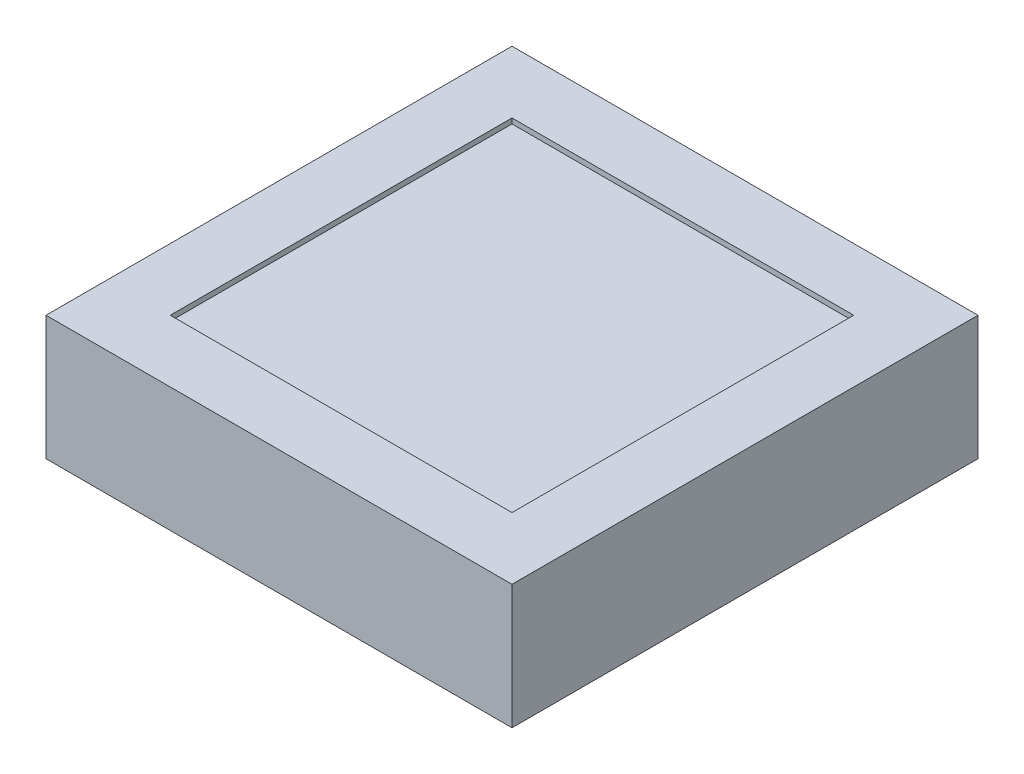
from build123d import *

# Parameters (mm, degrees)
CROQUIS1_W              = 90
CROQUIS1_H              = 90
SALIENTE_EXTRUIR1_DEPTH = 24
CROQUIS3_W              = 66
CROQUIS3_H              = 66
CORTAR_EXTRUIR2_DEPTH   = 1


with BuildPart() as part:
    # Croquis1 → Saliente-Extruir1 (new body)
    with BuildSketch(Plane(origin=(0, 0, 0), x_dir=(1, 0, 0), z_dir=(0, 1, 0))):
        with Locations((99.143471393, -100.254894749)):
            Rectangle(CROQUIS1_W, CROQUIS1_H)
    extrude(amount=SALIENTE_EXTRUIR1_DEPTH)

    # Croquis3 → Cortar-Extruir2 (cut)
    with BuildSketch(Plane(origin=(0, 24, 0), x_dir=(1, 0, 0), z_dir=(0, 1, 0))):
        with Locations((99.143471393, -100.254894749)):
            Rectangle(CROQUIS3_W, CROQUIS3_H)
    extrude(amount=-CORTAR_EXTRUIR2_DEPTH, mode=Mode.SUBTRACT)


solid = part.part
